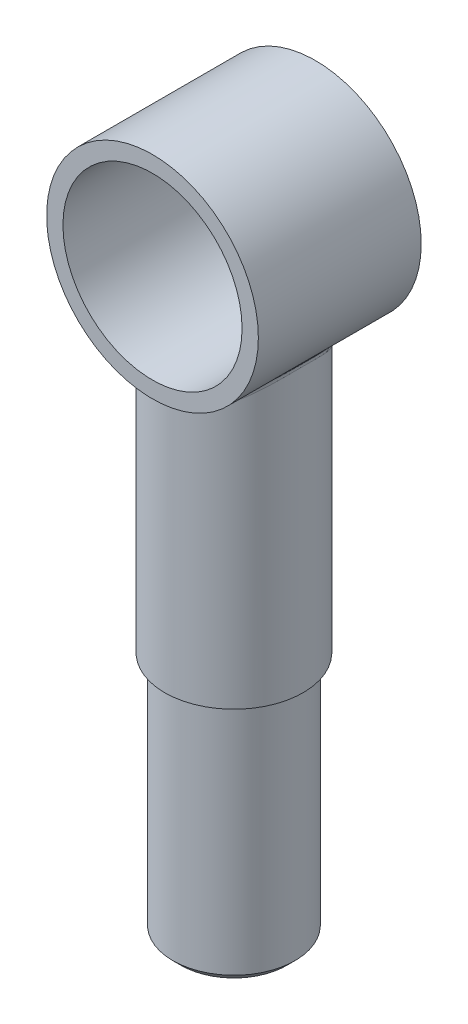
from build123d import *

# Parameters (mm, degrees)
ESQUISSE1_R             = 13
BASE_EXTRUSION_DEPTH    = 10
ESQUISSE2_R             = 8.5
BOSS_EXTRU_1_DEPTH      = 45
CONG_1_R                = 1
ESQUISSE5_R             = 7.5
BOSS_EXTRU_2_DEPTH      = 75
ESQUISSE3_R             = 11
ENL_V_MAT_EXTRU_1_DEPTH = 79.701969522
CHANFREIN1_SIZE         = 1


with BuildPart() as part:
    # Esquisse1 → Base-Extrusion (new, symmetric)
    with BuildSketch(Plane.XY):
        Circle(ESQUISSE1_R)
    extrude(amount=BASE_EXTRUSION_DEPTH, both=True)

    # Esquisse2 → Boss.-Extru.1 (add)
    with BuildSketch(Plane(origin=(0, 0, 0), x_dir=(1, 0, 0), z_dir=(0, 1, 0))):
        with Locations(Location((0, 0, 0), (0, 0, 270))):
            Circle(ESQUISSE2_R)
    extrude(amount=-BOSS_EXTRU_1_DEPTH)

    # Cong_1
    cong_1_edges = [part.edges().sort_by_distance(p)[0] for p in [
        (-1e-09, -13.000000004, -8.5),
    ]]
    fillet(cong_1_edges, radius=CONG_1_R)

    # Esquisse5 → Boss.-Extru.2 (add)
    with BuildSketch(Plane(origin=(0, 0, 0), x_dir=(1, 0, 0), z_dir=(0, 1, 0))):
        with Locations(Location((0, 0, 0), (0, 0, 270))):
            Circle(ESQUISSE5_R)
    extrude(amount=-BOSS_EXTRU_2_DEPTH)

    # Esquisse3 → Enl_v. mat.-Extru.1 (cut, through all)
    with BuildSketch(Plane.XY.offset(10)):
        Circle(ESQUISSE3_R)
    extrude(amount=-ENL_V_MAT_EXTRU_1_DEPTH, mode=Mode.SUBTRACT)

    # Chanfrein1
    chanfrein1_edges = [part.edges().sort_by_distance(p)[0] for p in [
        (0, -75, -7.5),
    ]]
    chamfer(chanfrein1_edges, length=CHANFREIN1_SIZE)


solid = part.part
